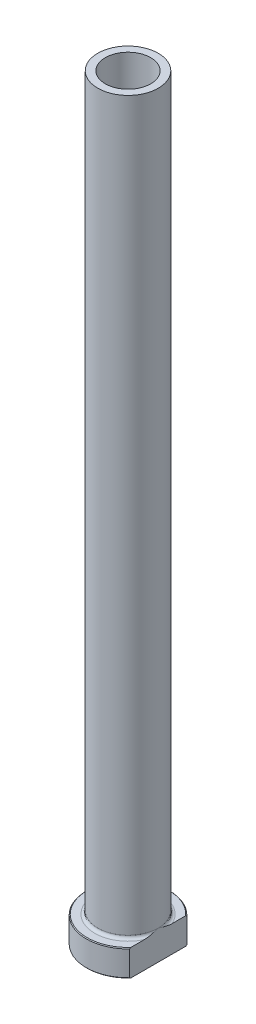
ISO-10303-21;
HEADER;
FILE_DESCRIPTION(('STEP AP214'),'2;1');
FILE_NAME('part.step','',(''),(''),'','','');
FILE_SCHEMA(('AUTOMOTIVE_DESIGN { 1 0 10303 214 1 1 1 1 }'));
ENDSEC;
DATA;
#1=APPLICATION_CONTEXT('core data for automotive mechanical design processes');
#2=APPLICATION_PROTOCOL_DEFINITION('international standard','automotive_design',2000,#1);
#3=PRODUCT_CONTEXT('',#1,'mechanical');
#4=PRODUCT('Part','Part','',(#3));
#5=PRODUCT_RELATED_PRODUCT_CATEGORY('part','',(#4));
#6=PRODUCT_DEFINITION_FORMATION('','',#4);
#7=PRODUCT_DEFINITION_CONTEXT('part definition',#1,'design');
#8=PRODUCT_DEFINITION('design','',#6,#7);
#9=PRODUCT_DEFINITION_SHAPE('','',#8);
#10=(LENGTH_UNIT() NAMED_UNIT(*) SI_UNIT(.MILLI.,.METRE.));
#11=(NAMED_UNIT(*) PLANE_ANGLE_UNIT() SI_UNIT($,.RADIAN.));
#12=(NAMED_UNIT(*) SI_UNIT($,.STERADIAN.) SOLID_ANGLE_UNIT());
#13=UNCERTAINTY_MEASURE_WITH_UNIT(LENGTH_MEASURE(1.E-05),#10,'distance_accuracy_value','');
#14=(GEOMETRIC_REPRESENTATION_CONTEXT(3) GLOBAL_UNCERTAINTY_ASSIGNED_CONTEXT((#13)) GLOBAL_UNIT_ASSIGNED_CONTEXT((#10,
#11,#12)) REPRESENTATION_CONTEXT('',''));
#15=CARTESIAN_POINT('',(0.,0.,0.));
#16=DIRECTION('',(0.,0.,1.));
#17=DIRECTION('',(1.,0.,0.));
#18=AXIS2_PLACEMENT_3D('',#15,#16,#17);
#19=CARTESIAN_POINT('',(0.,92.1876809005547,0.));
#20=DIRECTION('',(0.,1.,0.));
#21=DIRECTION('',(0.,0.,1.));
#22=AXIS2_PLACEMENT_3D('',#19,#20,#21);
#23=CYLINDRICAL_SURFACE('',#22,6.);
#24=CARTESIAN_POINT('',(0.,200.,0.));
#25=DIRECTION('',(0.,1.,0.));
#26=DIRECTION('',(0.,0.,1.));
#27=AXIS2_PLACEMENT_3D('',#24,#25,#26);
#28=CIRCLE('',#27,6.);
#29=CARTESIAN_POINT('',(0.,200.,6.));
#30=VERTEX_POINT('',#29);
#31=EDGE_CURVE('E167',#30,#30,#28,.T.);
#32=ORIENTED_EDGE('',*,*,#31,.T.);
#33=EDGE_LOOP('',(#32));
#34=FACE_BOUND('',#33,.T.);
#35=CARTESIAN_POINT('',(0.,145.,0.));
#36=DIRECTION('',(0.,1.,0.));
#37=DIRECTION('',(0.,0.,1.));
#38=AXIS2_PLACEMENT_3D('',#35,#36,#37);
#39=CIRCLE('',#38,6.);
#40=CARTESIAN_POINT('',(0.,145.,6.));
#41=VERTEX_POINT('',#40);
#42=EDGE_CURVE('E170',#41,#41,#39,.T.);
#43=ORIENTED_EDGE('',*,*,#42,.F.);
#44=EDGE_LOOP('',(#43));
#45=FACE_BOUND('',#44,.T.);
#46=ADVANCED_FACE('F32',(#34,#45),#23,.F.);
#47=CARTESIAN_POINT('',(-6.,200.,0.));
#48=DIRECTION('',(0.,1.,0.));
#49=DIRECTION('',(0.,0.,1.));
#50=AXIS2_PLACEMENT_3D('',#47,#48,#49);
#51=PLANE('',#50);
#52=CARTESIAN_POINT('',(0.,200.,0.));
#53=DIRECTION('',(0.,1.,0.));
#54=DIRECTION('',(0.,0.,1.));
#55=AXIS2_PLACEMENT_3D('',#52,#53,#54);
#56=CIRCLE('',#55,8.00000000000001);
#57=CARTESIAN_POINT('',(0.,200.,8.00000000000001));
#58=VERTEX_POINT('',#57);
#59=EDGE_CURVE('E174',#58,#58,#56,.T.);
#60=ORIENTED_EDGE('',*,*,#59,.T.);
#61=EDGE_LOOP('',(#60));
#62=FACE_BOUND('',#61,.T.);
#63=ORIENTED_EDGE('',*,*,#31,.F.);
#64=EDGE_LOOP('',(#63));
#65=FACE_BOUND('',#64,.T.);
#66=ADVANCED_FACE('F157',(#62,#65),#51,.T.);
#67=CARTESIAN_POINT('',(0.,92.1876809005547,0.));
#68=DIRECTION('',(0.,1.,0.));
#69=DIRECTION('',(0.,0.,1.));
#70=AXIS2_PLACEMENT_3D('',#67,#68,#69);
#71=CYLINDRICAL_SURFACE('',#70,8.);
#72=CARTESIAN_POINT('',(0.,7.8,0.));
#73=DIRECTION('',(0.,1.,0.));
#74=DIRECTION('',(0.,0.,1.));
#75=AXIS2_PLACEMENT_3D('',#72,#73,#74);
#76=CIRCLE('',#75,8.);
#77=CARTESIAN_POINT('',(8.,7.8,0.));
#78=VERTEX_POINT('',#77);
#79=EDGE_CURVE('E180',#78,#78,#76,.T.);
#80=ORIENTED_EDGE('',*,*,#79,.T.);
#81=EDGE_LOOP('',(#80));
#82=FACE_BOUND('',#81,.T.);
#83=ORIENTED_EDGE('',*,*,#59,.F.);
#84=EDGE_LOOP('',(#83));
#85=FACE_BOUND('',#84,.T.);
#86=ADVANCED_FACE('F162',(#82,#85),#71,.T.);
#87=CARTESIAN_POINT('',(-7.99999999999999,7.,0.));
#88=DIRECTION('',(0.,1.,0.));
#89=DIRECTION('',(0.,0.,1.));
#90=AXIS2_PLACEMENT_3D('',#87,#88,#89);
#91=PLANE('',#90);
#92=DIRECTION('',(0.,0.,1.));
#93=VECTOR('',#92,1.);
#94=CARTESIAN_POINT('',(8.,7.,0.));
#95=LINE('',#94,#93);
#96=CARTESIAN_POINT('',(8.,7.,-7.25534285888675));
#97=VERTEX_POINT('',#96);
#98=CARTESIAN_POINT('',(8.,7.,-3.66606055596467));
#99=VERTEX_POINT('',#98);
#100=EDGE_CURVE('E54',#97,#99,#95,.T.);
#101=ORIENTED_EDGE('',*,*,#100,.F.);
#102=CARTESIAN_POINT('',(0.,7.,0.));
#103=DIRECTION('',(0.,1.,0.));
#104=DIRECTION('',(0.,0.,1.));
#105=AXIS2_PLACEMENT_3D('',#102,#103,#104);
#106=CIRCLE('',#105,10.8);
#107=CARTESIAN_POINT('',(8.,7.,7.25534285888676));
#108=VERTEX_POINT('',#107);
#109=EDGE_CURVE('E186',#97,#108,#106,.T.);
#110=ORIENTED_EDGE('',*,*,#109,.T.);
#111=CARTESIAN_POINT('',(8.,7.,3.66606055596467));
#112=VERTEX_POINT('',#111);
#113=EDGE_CURVE('E134',#112,#108,#95,.T.);
#114=ORIENTED_EDGE('',*,*,#113,.F.);
#115=CARTESIAN_POINT('',(0.,7.,0.));
#116=DIRECTION('',(0.,1.,0.));
#117=DIRECTION('',(0.,0.,1.));
#118=AXIS2_PLACEMENT_3D('',#115,#116,#117);
#119=CIRCLE('',#118,8.8);
#120=EDGE_CURVE('E183',#112,#99,#119,.F.);
#121=ORIENTED_EDGE('',*,*,#120,.T.);
#122=EDGE_LOOP('',(#101,#110,#114,#121));
#123=FACE_BOUND('',#122,.T.);
#124=ADVANCED_FACE('F197',(#123),#91,.T.);
#125=CARTESIAN_POINT('',(0.,92.1876809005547,0.));
#126=DIRECTION('',(0.,1.,0.));
#127=DIRECTION('',(0.,0.,1.));
#128=AXIS2_PLACEMENT_3D('',#125,#126,#127);
#129=CYLINDRICAL_SURFACE('',#128,11.);
#130=DIRECTION('',(0.,-1.,0.));
#131=VECTOR('',#130,1.);
#132=CARTESIAN_POINT('',(8.,200.,7.54983443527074));
#133=LINE('',#132,#131);
#134=CARTESIAN_POINT('',(8.,6.79999999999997,7.54983443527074));
#135=VERTEX_POINT('',#134);
#136=CARTESIAN_POINT('',(8.,0.200000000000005,7.54983443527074));
#137=VERTEX_POINT('',#136);
#138=EDGE_CURVE('E82',#135,#137,#133,.T.);
#139=ORIENTED_EDGE('',*,*,#138,.F.);
#140=CARTESIAN_POINT('',(0.,6.79999999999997,0.));
#141=DIRECTION('',(0.,1.,0.));
#142=DIRECTION('',(0.,0.,1.));
#143=AXIS2_PLACEMENT_3D('',#140,#141,#142);
#144=CIRCLE('',#143,11.);
#145=CARTESIAN_POINT('',(8.,6.79999999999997,-7.54983443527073));
#146=VERTEX_POINT('',#145);
#147=EDGE_CURVE('E95',#135,#146,#144,.F.);
#148=ORIENTED_EDGE('',*,*,#147,.T.);
#149=DIRECTION('',(0.,-1.,0.));
#150=VECTOR('',#149,1.);
#151=CARTESIAN_POINT('',(8.,200.,-7.54983443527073));
#152=LINE('',#151,#150);
#153=CARTESIAN_POINT('',(8.,0.200000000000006,-7.54983443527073));
#154=VERTEX_POINT('',#153);
#155=EDGE_CURVE('E192',#146,#154,#152,.T.);
#156=ORIENTED_EDGE('',*,*,#155,.T.);
#157=CARTESIAN_POINT('',(0.,0.200000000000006,0.));
#158=DIRECTION('',(0.,-1.,0.));
#159=DIRECTION('',(0.,0.,-1.));
#160=AXIS2_PLACEMENT_3D('',#157,#158,#159);
#161=CIRCLE('',#160,11.);
#162=EDGE_CURVE('E98',#154,#137,#161,.F.);
#163=ORIENTED_EDGE('',*,*,#162,.T.);
#164=EDGE_LOOP('',(#139,#148,#156,#163));
#165=FACE_BOUND('',#164,.T.);
#166=ADVANCED_FACE('F190',(#165),#129,.T.);
#167=CARTESIAN_POINT('',(-11.,0.,0.));
#168=DIRECTION('',(0.,-1.,0.));
#169=DIRECTION('',(0.,0.,-1.));
#170=AXIS2_PLACEMENT_3D('',#167,#168,#169);
#171=PLANE('',#170);
#172=CARTESIAN_POINT('',(0.,0.,0.));
#173=DIRECTION('',(0.,-1.,0.));
#174=DIRECTION('',(0.,0.,-1.));
#175=AXIS2_PLACEMENT_3D('',#172,#173,#174);
#176=CIRCLE('',#175,6.75000000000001);
#177=CARTESIAN_POINT('',(0.,0.,-6.75000000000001));
#178=VERTEX_POINT('',#177);
#179=EDGE_CURVE('E40',#178,#178,#176,.F.);
#180=ORIENTED_EDGE('',*,*,#179,.T.);
#181=EDGE_LOOP('',(#180));
#182=FACE_BOUND('',#181,.T.);
#183=DIRECTION('',(0.,0.,-1.));
#184=VECTOR('',#183,1.);
#185=CARTESIAN_POINT('',(8.,0.,7.54983443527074));
#186=LINE('',#185,#184);
#187=CARTESIAN_POINT('',(8.,0.,7.25534285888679));
#188=VERTEX_POINT('',#187);
#189=CARTESIAN_POINT('',(8.,0.,-7.25534285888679));
#190=VERTEX_POINT('',#189);
#191=EDGE_CURVE('E47',#188,#190,#186,.T.);
#192=ORIENTED_EDGE('',*,*,#191,.F.);
#193=CARTESIAN_POINT('',(0.,0.,0.));
#194=DIRECTION('',(0.,-1.,0.));
#195=DIRECTION('',(0.,0.,-1.));
#196=AXIS2_PLACEMENT_3D('',#193,#194,#195);
#197=CIRCLE('',#196,10.8);
#198=EDGE_CURVE('E92',#188,#190,#197,.T.);
#199=ORIENTED_EDGE('',*,*,#198,.T.);
#200=EDGE_LOOP('',(#192,#199));
#201=FACE_BOUND('',#200,.T.);
#202=ADVANCED_FACE('F91',(#182,#201),#171,.T.);
#203=CARTESIAN_POINT('',(0.,92.1876809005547,0.));
#204=DIRECTION('',(0.,1.,0.));
#205=DIRECTION('',(0.,0.,1.));
#206=AXIS2_PLACEMENT_3D('',#203,#204,#205);
#207=CYLINDRICAL_SURFACE('',#206,6.25);
#208=CARTESIAN_POINT('',(0.,0.500000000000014,0.));
#209=DIRECTION('',(0.,-1.,0.));
#210=DIRECTION('',(0.,0.,-1.));
#211=AXIS2_PLACEMENT_3D('',#208,#209,#210);
#212=CIRCLE('',#211,6.25);
#213=CARTESIAN_POINT('',(0.,0.500000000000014,-6.25));
#214=VERTEX_POINT('',#213);
#215=EDGE_CURVE('E11',#214,#214,#212,.T.);
#216=ORIENTED_EDGE('',*,*,#215,.T.);
#217=EDGE_LOOP('',(#216));
#218=FACE_BOUND('',#217,.T.);
#219=CARTESIAN_POINT('',(0.,133.,0.));
#220=DIRECTION('',(0.,1.,0.));
#221=DIRECTION('',(0.,0.,1.));
#222=AXIS2_PLACEMENT_3D('',#219,#220,#221);
#223=CIRCLE('',#222,6.25000000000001);
#224=CARTESIAN_POINT('',(0.,133.,6.25000000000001));
#225=VERTEX_POINT('',#224);
#226=EDGE_CURVE('E172',#225,#225,#223,.T.);
#227=ORIENTED_EDGE('',*,*,#226,.T.);
#228=EDGE_LOOP('',(#227));
#229=FACE_BOUND('',#228,.T.);
#230=ADVANCED_FACE('F215',(#218,#229),#207,.F.);
#231=CARTESIAN_POINT('',(0.,133.,0.));
#232=DIRECTION('',(0.,-1.,0.));
#233=DIRECTION('',(0.,0.,-1.));
#234=AXIS2_PLACEMENT_3D('',#231,#232,#233);
#235=CONICAL_SURFACE('',#234,6.25000000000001,0.0208303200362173);
#236=ORIENTED_EDGE('',*,*,#42,.T.);
#237=EDGE_LOOP('',(#236));
#238=FACE_BOUND('',#237,.T.);
#239=ORIENTED_EDGE('',*,*,#226,.F.);
#240=EDGE_LOOP('',(#239));
#241=FACE_BOUND('',#240,.T.);
#242=ADVANCED_FACE('F111',(#238,#241),#235,.F.);
#243=CARTESIAN_POINT('',(0.,7.8,0.));
#244=DIRECTION('',(0.,1.,0.));
#245=DIRECTION('',(0.,0.,1.));
#246=AXIS2_PLACEMENT_3D('',#243,#244,#245);
#247=TOROIDAL_SURFACE('',#246,8.8,0.8);
#248=ORIENTED_EDGE('',*,*,#120,.F.);
#249=CARTESIAN_POINT('',(8.,7.8,0.));
#250=CARTESIAN_POINT('',(8.,7.80000101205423,-1.09664135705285E-10));
#251=CARTESIAN_POINT('',(8.,7.80000202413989,2.93324043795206E-07));
#252=CARTESIAN_POINT('',(8.,7.80000394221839,1.16283081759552E-06));
#253=CARTESIAN_POINT('',(8.,7.80000483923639,1.75365124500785E-06));
#254=CARTESIAN_POINT('',(8.,7.80000665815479,3.16446762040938E-06));
#255=CARTESIAN_POINT('',(8.,7.80000756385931,4.00549142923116E-06));
#256=CARTESIAN_POINT('',(8.,7.8000092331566,5.78347900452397E-06));
#257=CARTESIAN_POINT('',(8.,7.80000999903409,6.71842005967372E-06));
#258=CARTESIAN_POINT('',(8.,7.80001270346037,1.02037213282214E-05));
#259=CARTESIAN_POINT('',(8.,7.80001449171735,1.28740398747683E-05));
#260=CARTESIAN_POINT('',(8.,7.80001755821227,1.82727381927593E-05));
#261=CARTESIAN_POINT('',(8.,7.80001886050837,2.09881553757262E-05));
#262=CARTESIAN_POINT('',(8.,7.80002405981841,3.2064780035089E-05));
#263=CARTESIAN_POINT('',(8.,7.80002777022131,4.05225581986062E-05));
#264=CARTESIAN_POINT('',(8.,7.80003348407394,5.68037698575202E-05));
#265=CARTESIAN_POINT('',(8.,7.80003564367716,6.45728866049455E-05));
#266=CARTESIAN_POINT('',(8.,7.80005093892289,0.000121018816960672));
#267=CARTESIAN_POINT('',(8.,7.80006211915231,0.000170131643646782));
#268=CARTESIAN_POINT('',(8.,7.80011100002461,0.000362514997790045));
#269=CARTESIAN_POINT('',(8.,7.80015802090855,0.00050331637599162));
#270=CARTESIAN_POINT('',(8.,7.80033939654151,0.00105711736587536));
#271=CARTESIAN_POINT('',(8.,7.80046737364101,0.0014716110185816));
#272=CARTESIAN_POINT('',(8.,7.80097644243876,0.00310648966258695));
#273=CARTESIAN_POINT('',(8.,7.80136531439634,0.00432501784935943));
#274=CARTESIAN_POINT('',(8.,7.80297358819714,0.00937955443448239));
#275=CARTESIAN_POINT('',(8.,7.80418342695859,0.0132178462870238));
#276=CARTESIAN_POINT('',(7.99999999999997,7.82754122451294,0.0873020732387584));
#277=CARTESIAN_POINT('',(7.99999999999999,7.84979021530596,0.157524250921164));
#278=CARTESIAN_POINT('',(8.00000000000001,7.89322681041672,0.295235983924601));
#279=CARTESIAN_POINT('',(8.,7.91442151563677,0.362723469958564));
#280=CARTESIAN_POINT('',(8.,7.9592343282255,0.506178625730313));
#281=CARTESIAN_POINT('',(8.,7.98282525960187,0.582154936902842));
#282=CARTESIAN_POINT('',(8.,8.02983069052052,0.735069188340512));
#283=CARTESIAN_POINT('',(8.,8.05324046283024,0.812008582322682));
#284=CARTESIAN_POINT('',(8.,8.0930379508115,0.944645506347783));
#285=CARTESIAN_POINT('',(8.,8.10956807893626,1.0003002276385));
#286=CARTESIAN_POINT('',(8.,8.14221289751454,1.11157683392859));
#287=CARTESIAN_POINT('',(8.,8.15832854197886,1.16719843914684));
#288=CARTESIAN_POINT('',(8.,8.20527739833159,1.33164052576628));
#289=CARTESIAN_POINT('',(8.,8.23549814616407,1.44063711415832));
#290=CARTESIAN_POINT('',(8.,8.29826335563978,1.67606835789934));
#291=CARTESIAN_POINT('',(8.,8.33044741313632,1.80259995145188));
#292=CARTESIAN_POINT('',(8.,8.39126396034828,2.05750030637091));
#293=CARTESIAN_POINT('',(8.,8.41986879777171,2.18587573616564));
#294=CARTESIAN_POINT('',(8.,8.47414203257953,2.45321874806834));
#295=CARTESIAN_POINT('',(8.,8.49943375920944,2.59226394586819));
#296=CARTESIAN_POINT('',(8.,8.54278750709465,2.87150561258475));
#297=CARTESIAN_POINT('',(8.,8.56085024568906,3.0117019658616));
#298=CARTESIAN_POINT('',(8.,8.5829128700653,3.2431945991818));
#299=CARTESIAN_POINT('',(8.,8.58962750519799,3.33423069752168));
#300=CARTESIAN_POINT('',(8.,8.59844042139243,3.51651109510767));
#301=CARTESIAN_POINT('',(8.,8.60054027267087,3.60775531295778));
#302=CARTESIAN_POINT('',(8.,8.59923478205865,3.78855451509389));
#303=CARTESIAN_POINT('',(8.,8.59592927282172,3.87810991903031));
#304=CARTESIAN_POINT('',(8.,8.58288784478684,4.05671727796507));
#305=CARTESIAN_POINT('',(8.,8.57315718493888,4.14576958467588));
#306=CARTESIAN_POINT('',(8.,8.54786053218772,4.30910044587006));
#307=CARTESIAN_POINT('',(8.,8.53341905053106,4.38354919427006));
#308=CARTESIAN_POINT('',(8.,8.49747543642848,4.53120906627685));
#309=CARTESIAN_POINT('',(8.,8.47593618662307,4.60441150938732));
#310=CARTESIAN_POINT('',(8.,8.42376924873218,4.74853436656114));
#311=CARTESIAN_POINT('',(8.,8.39303920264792,4.81941853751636));
#312=CARTESIAN_POINT('',(8.,8.32008168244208,4.9549058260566));
#313=CARTESIAN_POINT('',(8.,8.27792970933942,5.01954653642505));
#314=CARTESIAN_POINT('',(8.,8.20692535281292,5.10354772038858));
#315=CARTESIAN_POINT('',(8.,8.183978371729,5.1278859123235));
#316=CARTESIAN_POINT('',(8.,8.13503511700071,5.17336988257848));
#317=CARTESIAN_POINT('',(8.,8.10903727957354,5.19451401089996));
#318=CARTESIAN_POINT('',(8.,8.05362521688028,5.23266411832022));
#319=CARTESIAN_POINT('',(8.,8.02417247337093,5.2496152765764));
#320=CARTESIAN_POINT('',(8.,7.96255238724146,5.27751973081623));
#321=CARTESIAN_POINT('',(8.,7.93039220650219,5.28848831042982));
#322=CARTESIAN_POINT('',(8.,7.87282733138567,5.30129051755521));
#323=CARTESIAN_POINT('',(8.,7.84777777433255,5.30473535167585));
#324=CARTESIAN_POINT('',(8.,7.79745799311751,5.30730687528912));
#325=CARTESIAN_POINT('',(8.,7.77218785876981,5.30643524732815));
#326=CARTESIAN_POINT('',(8.,7.72220872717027,5.30045124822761));
#327=CARTESIAN_POINT('',(8.,7.69749884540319,5.29534612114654));
#328=CARTESIAN_POINT('',(8.,7.6491985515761,5.28130622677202));
#329=CARTESIAN_POINT('',(8.,7.62560888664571,5.27236894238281));
#330=CARTESIAN_POINT('',(8.,7.57186978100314,5.24749103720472));
#331=CARTESIAN_POINT('',(8.,7.54235117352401,5.23019143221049));
#332=CARTESIAN_POINT('',(8.,7.48647501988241,5.19107874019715));
#333=CARTESIAN_POINT('',(8.,7.4601247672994,5.16925554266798));
#334=CARTESIAN_POINT('',(8.,7.3975813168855,5.11005232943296));
#335=CARTESIAN_POINT('',(8.,7.36345256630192,5.0705073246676));
#336=CARTESIAN_POINT('',(8.,7.30158414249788,4.98680536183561));
#337=CARTESIAN_POINT('',(8.,7.27385227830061,4.94264286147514));
#338=CARTESIAN_POINT('',(8.,7.2265563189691,4.85651446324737));
#339=CARTESIAN_POINT('',(8.,7.20642608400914,4.81485346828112));
#340=CARTESIAN_POINT('',(8.,7.16979237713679,4.72995016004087));
#341=CARTESIAN_POINT('',(8.,7.15329194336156,4.68670655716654));
#342=CARTESIAN_POINT('',(8.,7.10824755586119,4.55471342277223));
#343=CARTESIAN_POINT('',(8.,7.08448205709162,4.46433285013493));
#344=CARTESIAN_POINT('',(8.,7.04606817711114,4.27884520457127));
#345=CARTESIAN_POINT('',(8.,7.03172934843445,4.18367881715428));
#346=CARTESIAN_POINT('',(8.,7.01115182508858,3.99231790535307));
#347=CARTESIAN_POINT('',(8.,7.00492963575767,3.89612168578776));
#348=CARTESIAN_POINT('',(8.,6.99917472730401,3.70683203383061));
#349=CARTESIAN_POINT('',(8.,6.99942213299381,3.61374410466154));
#350=CARTESIAN_POINT('',(8.,7.00500334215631,3.42814181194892));
#351=CARTESIAN_POINT('',(8.,7.01031504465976,3.33562671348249));
#352=CARTESIAN_POINT('',(8.,7.02729273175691,3.12465235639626));
#353=CARTESIAN_POINT('',(8.,7.04033732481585,3.0063061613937));
#354=CARTESIAN_POINT('',(8.,7.07206018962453,2.77043320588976));
#355=CARTESIAN_POINT('',(8.,7.09073668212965,2.65290619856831));
#356=CARTESIAN_POINT('',(8.,7.13314336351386,2.41598317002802));
#357=CARTESIAN_POINT('',(8.,7.15698005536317,2.29660645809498));
#358=CARTESIAN_POINT('',(8.,7.20856500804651,2.05839418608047));
#359=CARTESIAN_POINT('',(8.,7.23632304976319,1.9395607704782));
#360=CARTESIAN_POINT('',(8.,7.30538420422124,1.66026758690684));
#361=CARTESIAN_POINT('',(8.,7.3479797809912,1.50012949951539));
#362=CARTESIAN_POINT('',(8.,7.43661699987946,1.18271330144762));
#363=CARTESIAN_POINT('',(8.,7.48261587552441,1.02542306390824));
#364=CARTESIAN_POINT('',(8.,7.55073856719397,0.798945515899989));
#365=CARTESIAN_POINT('',(8.,7.57189590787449,0.729464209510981));
#366=CARTESIAN_POINT('',(8.,7.61466169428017,0.590318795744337));
#367=CARTESIAN_POINT('',(8.,7.63627166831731,0.52065515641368));
#368=CARTESIAN_POINT('',(8.,7.68075896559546,0.378072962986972));
#369=CARTESIAN_POINT('',(8.00000000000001,7.70364749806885,0.305157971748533));
#370=CARTESIAN_POINT('',(7.99999999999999,7.74926260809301,0.16052269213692));
#371=CARTESIAN_POINT('',(7.99999999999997,7.77198614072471,0.0888015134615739));
#372=CARTESIAN_POINT('',(8.,7.79581756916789,0.0132146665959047));
#373=CARTESIAN_POINT('',(8.,7.79702841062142,0.00937319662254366));
#374=CARTESIAN_POINT('',(8.,7.79863692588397,0.00431792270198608));
#375=CARTESIAN_POINT('',(8.,7.79902501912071,0.00310183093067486));
#376=CARTESIAN_POINT('',(8.,7.79953313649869,0.00147000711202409));
#377=CARTESIAN_POINT('',(8.,7.79966092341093,0.00105612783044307));
#378=CARTESIAN_POINT('',(8.,7.7998420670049,0.000503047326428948));
#379=CARTESIAN_POINT('',(8.,7.79988905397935,0.000362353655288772));
#380=CARTESIAN_POINT('',(8.,7.79993790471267,0.000170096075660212));
#381=CARTESIAN_POINT('',(8.,7.79994908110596,0.000120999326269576));
#382=CARTESIAN_POINT('',(8.,7.7999643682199,6.45695818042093E-05));
#383=CARTESIAN_POINT('',(8.,7.7999665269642,5.68014487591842E-05));
#384=CARTESIAN_POINT('',(8.,7.79997223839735,4.05221710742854E-05));
#385=CARTESIAN_POINT('',(8.,7.79997594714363,3.20652931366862E-05));
#386=CARTESIAN_POINT('',(8.,7.79998114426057,2.09895708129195E-05));
#387=CARTESIAN_POINT('',(8.,7.79998244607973,1.82742270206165E-05));
#388=CARTESIAN_POINT('',(8.,7.7999855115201,1.28755893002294E-05));
#389=CARTESIAN_POINT('',(8.,7.79998729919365,1.02052505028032E-05));
#390=CARTESIAN_POINT('',(8.,7.79999000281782,6.71981903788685E-06));
#391=CARTESIAN_POINT('',(8.,7.79999076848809,5.78481830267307E-06));
#392=CARTESIAN_POINT('',(8.,7.79999243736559,4.00667403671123E-06));
#393=CARTESIAN_POINT('',(8.,7.79999334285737,3.16555239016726E-06));
#394=CARTESIAN_POINT('',(8.,7.79999516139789,1.75450243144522E-06));
#395=CARTESIAN_POINT('',(8.,7.79999605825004,1.16355323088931E-06));
#396=CARTESIAN_POINT('',(8.,7.7999979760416,2.9372828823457E-07));
#397=CARTESIAN_POINT('',(8.,7.79999898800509,1.09661384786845E-10));
#398=CARTESIAN_POINT('',(8.,7.8,0.));
#399=B_SPLINE_CURVE_WITH_KNOTS('',3,(#249,#250,#251,#252,#253,#254,#255,#256,#257,#258,#259,
#260,#261,#262,#263,#264,#265,#266,#267,#268,#269,#270,#271,#272,#273,#274,#275,#276,#277,#278,
#279,#280,#281,#282,#283,#284,#285,#286,#287,#288,#289,#290,#291,#292,#293,#294,#295,#296,#297,
#298,#299,#300,#301,#302,#303,#304,#305,#306,#307,#308,#309,#310,#311,#312,#313,#314,#315,#316,
#317,#318,#319,#320,#321,#322,#323,#324,#325,#326,#327,#328,#329,#330,#331,#332,#333,#334,#335,
#336,#337,#338,#339,#340,#341,#342,#343,#344,#345,#346,#347,#348,#349,#350,#351,#352,#353,#354,
#355,#356,#357,#358,#359,#360,#361,#362,#363,#364,#365,#366,#367,#368,#369,#370,#371,#372,#373,
#374,#375,#376,#377,#378,#379,#380,#381,#382,#383,#384,#385,#386,#387,#388,#389,#390,#391,#392,
#393,#394,#395,#396,#397,#398),.UNSPECIFIED.,.T.,.F.,(4,2,2,2,2,2,2,2,2,2,2,2,2,2,2,2,2,2,2,2,2,
2,2,2,2,2,2,2,2,2,2,2,2,2,2,2,2,2,2,2,2,2,2,2,2,2,2,2,2,2,2,2,2,2,2,2,2,2,2,2,2,2,2,2,2,2,2,2,2,
2,2,2,2,2,4),(0.,3.04287568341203E-06,6.25420182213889E-06,9.94386523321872E-06,
1.35664344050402E-05,2.31665045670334E-05,3.21939836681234E-05,5.98353420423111E-05,
8.39944711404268E-05,0.000235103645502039,0.000679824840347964,0.00198183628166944,
0.00581831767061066,0.0178924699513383,0.238870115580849,0.451084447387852,0.689746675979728,
0.931010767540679,1.10518257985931,1.27890913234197,1.61821807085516,2.0098553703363,
2.40435266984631,2.82819297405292,3.25199120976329,3.52574836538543,3.7994123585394,
4.06807884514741,4.33652570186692,4.5637808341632,4.79224376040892,5.02335234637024,
5.25296903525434,5.35309534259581,5.45327319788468,5.5546987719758,5.65586400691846,
5.73137360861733,5.80685377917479,5.88220505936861,5.95760590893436,6.05967508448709,
6.16197489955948,6.31780492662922,6.47382418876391,6.61243130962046,6.75115400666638,
7.03070266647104,7.31902502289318,7.60793277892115,7.88703491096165,8.16492456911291,
8.52193605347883,8.87883486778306,9.24395493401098,9.61000233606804,10.1070420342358,
10.5986476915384,10.8165407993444,11.0353545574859,11.2646261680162,11.4903206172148,
11.5024047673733,11.5062335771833,11.5075336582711,11.5079780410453,11.5081291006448,
11.508153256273,11.5081808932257,11.5081899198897,11.5081995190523,11.5082031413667,
11.5082068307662,11.5082100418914,11.5082130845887),.UNSPECIFIED.);
#400=EDGE_CURVE('E126',#112,#78,#399,.T.);
#401=ORIENTED_EDGE('',*,*,#400,.T.);
#402=ORIENTED_EDGE('',*,*,#79,.F.);
#403=CARTESIAN_POINT('',(8.,7.8,0.));
#404=CARTESIAN_POINT('',(8.,7.79999898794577,1.09667374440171E-10));
#405=CARTESIAN_POINT('',(8.,7.79999797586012,-2.93324040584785E-07));
#406=CARTESIAN_POINT('',(8.,7.79999605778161,-1.16283081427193E-06));
#407=CARTESIAN_POINT('',(8.,7.79999516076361,-1.75365124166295E-06));
#408=CARTESIAN_POINT('',(8.,7.79999334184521,-3.16446761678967E-06));
#409=CARTESIAN_POINT('',(8.,7.7999924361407,-4.00549142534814E-06));
#410=CARTESIAN_POINT('',(8.,7.79999076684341,-5.78347900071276E-06));
#411=CARTESIAN_POINT('',(8.,7.79999000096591,-6.71842005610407E-06));
#412=CARTESIAN_POINT('',(8.,7.79998729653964,-1.02037213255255E-05));
#413=CARTESIAN_POINT('',(8.,7.79998550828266,-1.28740398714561E-05));
#414=CARTESIAN_POINT('',(8.,7.79998244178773,-1.82727381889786E-05));
#415=CARTESIAN_POINT('',(8.,7.79998113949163,-2.09881553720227E-05));
#416=CARTESIAN_POINT('',(8.,7.7999759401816,-3.2064780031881E-05));
#417=CARTESIAN_POINT('',(8.,7.7999722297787,-4.05225581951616E-05));
#418=CARTESIAN_POINT('',(8.,7.79996651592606,-5.68037698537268E-05));
#419=CARTESIAN_POINT('',(8.,7.79996435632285,-6.45728866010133E-05));
#420=CARTESIAN_POINT('',(8.,7.79994906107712,-0.000121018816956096));
#421=CARTESIAN_POINT('',(8.,7.79993788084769,-0.000170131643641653));
#422=CARTESIAN_POINT('',(8.,7.7998889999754,-0.000362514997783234));
#423=CARTESIAN_POINT('',(8.,7.79984197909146,-0.000503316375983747));
#424=CARTESIAN_POINT('',(8.,7.7996606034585,-0.00105711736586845));
#425=CARTESIAN_POINT('',(8.,7.79953262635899,-0.00147161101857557));
#426=CARTESIAN_POINT('',(8.,7.79902355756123,-0.00310648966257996));
#427=CARTESIAN_POINT('',(8.,7.79863468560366,-0.00432501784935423));
#428=CARTESIAN_POINT('',(8.,7.79702641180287,-0.00937955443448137));
#429=CARTESIAN_POINT('',(8.,7.79581657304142,-0.0132178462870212));
#430=CARTESIAN_POINT('',(7.99999999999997,7.772458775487,-0.087302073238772));
#431=CARTESIAN_POINT('',(7.99999999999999,7.750209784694,-0.157524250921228));
#432=CARTESIAN_POINT('',(8.00000000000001,7.70677318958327,-0.295235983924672));
#433=CARTESIAN_POINT('',(8.,7.68557848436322,-0.362723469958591));
#434=CARTESIAN_POINT('',(8.,7.6407656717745,-0.50617862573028));
#435=CARTESIAN_POINT('',(8.,7.61717474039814,-0.582154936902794));
#436=CARTESIAN_POINT('',(8.,7.5701693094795,-0.735069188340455));
#437=CARTESIAN_POINT('',(8.,7.54675953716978,-0.812008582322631));
#438=CARTESIAN_POINT('',(8.,7.50696204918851,-0.944645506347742));
#439=CARTESIAN_POINT('',(8.,7.49043192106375,-1.00030022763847));
#440=CARTESIAN_POINT('',(8.,7.45778710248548,-1.11157683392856));
#441=CARTESIAN_POINT('',(8.,7.44167145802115,-1.16719843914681));
#442=CARTESIAN_POINT('',(8.,7.39472260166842,-1.33164052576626));
#443=CARTESIAN_POINT('',(8.,7.36450185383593,-1.4406371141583));
#444=CARTESIAN_POINT('',(8.,7.30173664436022,-1.67606835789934));
#445=CARTESIAN_POINT('',(8.,7.26955258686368,-1.80259995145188));
#446=CARTESIAN_POINT('',(8.,7.20873603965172,-2.05750030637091));
#447=CARTESIAN_POINT('',(8.,7.18013120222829,-2.18587573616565));
#448=CARTESIAN_POINT('',(8.,7.12585796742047,-2.45321874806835));
#449=CARTESIAN_POINT('',(8.,7.10056624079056,-2.5922639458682));
#450=CARTESIAN_POINT('',(8.,7.05721249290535,-2.87150561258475));
#451=CARTESIAN_POINT('',(8.,7.03914975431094,-3.01170196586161));
#452=CARTESIAN_POINT('',(8.,7.0170871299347,-3.2431945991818));
#453=CARTESIAN_POINT('',(8.,7.01037249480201,-3.33423069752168));
#454=CARTESIAN_POINT('',(8.,7.00155957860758,-3.51651109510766));
#455=CARTESIAN_POINT('',(8.,6.99945972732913,-3.60775531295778));
#456=CARTESIAN_POINT('',(8.,7.00076521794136,-3.78855451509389));
#457=CARTESIAN_POINT('',(8.,7.00407072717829,-3.87810991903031));
#458=CARTESIAN_POINT('',(8.,7.01711215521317,-4.05671727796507));
#459=CARTESIAN_POINT('',(8.,7.02684281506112,-4.14576958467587));
#460=CARTESIAN_POINT('',(8.,7.05213946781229,-4.30910044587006));
#461=CARTESIAN_POINT('',(8.,7.06658094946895,-4.38354919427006));
#462=CARTESIAN_POINT('',(8.,7.10252456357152,-4.53120906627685));
#463=CARTESIAN_POINT('',(8.,7.12406381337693,-4.60441150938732));
#464=CARTESIAN_POINT('',(8.,7.17623075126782,-4.74853436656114));
#465=CARTESIAN_POINT('',(8.,7.20696079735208,-4.81941853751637));
#466=CARTESIAN_POINT('',(8.,7.27991831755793,-4.95490582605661));
#467=CARTESIAN_POINT('',(8.,7.32207029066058,-5.01954653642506));
#468=CARTESIAN_POINT('',(8.,7.39307464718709,-5.10354772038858));
#469=CARTESIAN_POINT('',(8.,7.41602162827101,-5.1278859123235));
#470=CARTESIAN_POINT('',(8.,7.4649648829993,-5.17336988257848));
#471=CARTESIAN_POINT('',(8.,7.49096272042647,-5.19451401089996));
#472=CARTESIAN_POINT('',(8.,7.54637478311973,-5.23266411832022));
#473=CARTESIAN_POINT('',(8.,7.57582752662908,-5.2496152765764));
#474=CARTESIAN_POINT('',(8.,7.63744761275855,-5.27751973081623));
#475=CARTESIAN_POINT('',(8.,7.66960779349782,-5.28848831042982));
#476=CARTESIAN_POINT('',(8.,7.72717266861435,-5.30129051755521));
#477=CARTESIAN_POINT('',(8.,7.75222222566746,-5.30473535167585));
#478=CARTESIAN_POINT('',(8.,7.8025420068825,-5.30730687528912));
#479=CARTESIAN_POINT('',(8.,7.8278121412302,-5.30643524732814));
#480=CARTESIAN_POINT('',(8.,7.87779127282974,-5.30045124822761));
#481=CARTESIAN_POINT('',(8.,7.90250115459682,-5.29534612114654));
#482=CARTESIAN_POINT('',(8.,7.95080144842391,-5.28130622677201));
#483=CARTESIAN_POINT('',(8.,7.97439111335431,-5.2723689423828));
#484=CARTESIAN_POINT('',(8.,8.02813021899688,-5.24749103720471));
#485=CARTESIAN_POINT('',(8.,8.057648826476,-5.23019143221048));
#486=CARTESIAN_POINT('',(8.,8.1135249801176,-5.19107874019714));
#487=CARTESIAN_POINT('',(8.,8.13987523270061,-5.16925554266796));
#488=CARTESIAN_POINT('',(8.,8.20241868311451,-5.11005232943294));
#489=CARTESIAN_POINT('',(8.,8.2365474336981,-5.07050732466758));
#490=CARTESIAN_POINT('',(8.,8.29841585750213,-4.98680536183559));
#491=CARTESIAN_POINT('',(8.,8.3261477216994,-4.94264286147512));
#492=CARTESIAN_POINT('',(8.,8.37344368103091,-4.85651446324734));
#493=CARTESIAN_POINT('',(8.,8.39357391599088,-4.8148534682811));
#494=CARTESIAN_POINT('',(8.,8.43020762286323,-4.72995016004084));
#495=CARTESIAN_POINT('',(8.,8.44670805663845,-4.6867065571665));
#496=CARTESIAN_POINT('',(8.,8.49175244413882,-4.55471342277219));
#497=CARTESIAN_POINT('',(8.,8.51551794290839,-4.46433285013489));
#498=CARTESIAN_POINT('',(8.,8.55393182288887,-4.27884520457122));
#499=CARTESIAN_POINT('',(8.,8.56827065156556,-4.18367881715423));
#500=CARTESIAN_POINT('',(8.,8.58884817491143,-3.99231790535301));
#501=CARTESIAN_POINT('',(8.,8.59507036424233,-3.89612168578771));
#502=CARTESIAN_POINT('',(8.,8.60082527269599,-3.70683203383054));
#503=CARTESIAN_POINT('',(8.,8.6005778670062,-3.61374410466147));
#504=CARTESIAN_POINT('',(8.,8.59499665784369,-3.42814181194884));
#505=CARTESIAN_POINT('',(8.,8.58968495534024,-3.3356267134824));
#506=CARTESIAN_POINT('',(8.,8.57270726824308,-3.12465235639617));
#507=CARTESIAN_POINT('',(8.,8.55966267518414,-3.00630616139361));
#508=CARTESIAN_POINT('',(8.,8.52793981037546,-2.77043320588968));
#509=CARTESIAN_POINT('',(8.,8.50926331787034,-2.65290619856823));
#510=CARTESIAN_POINT('',(8.,8.46685663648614,-2.41598317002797));
#511=CARTESIAN_POINT('',(8.,8.44301994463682,-2.29660645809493));
#512=CARTESIAN_POINT('',(8.,8.39143499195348,-2.05839418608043));
#513=CARTESIAN_POINT('',(8.,8.3636769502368,-1.93956077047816));
#514=CARTESIAN_POINT('',(8.,8.29461579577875,-1.66026758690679));
#515=CARTESIAN_POINT('',(8.,8.2520202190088,-1.50012949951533));
#516=CARTESIAN_POINT('',(8.,8.16338300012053,-1.18271330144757));
#517=CARTESIAN_POINT('',(8.,8.11738412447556,-1.02542306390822));
#518=CARTESIAN_POINT('',(8.,8.04926143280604,-0.798945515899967));
#519=CARTESIAN_POINT('',(8.,8.02810409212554,-0.729464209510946));
#520=CARTESIAN_POINT('',(8.,7.98533830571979,-0.590318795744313));
#521=CARTESIAN_POINT('',(8.,7.96372833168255,-0.520655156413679));
#522=CARTESIAN_POINT('',(8.,7.91924103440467,-0.378072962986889));
#523=CARTESIAN_POINT('',(8.00000000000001,7.89635250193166,-0.305157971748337));
#524=CARTESIAN_POINT('',(7.99999999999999,7.85073739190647,-0.160522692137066));
#525=CARTESIAN_POINT('',(7.99999999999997,7.82801385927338,-0.0888015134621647));
#526=CARTESIAN_POINT('',(8.,7.80418243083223,-0.0132146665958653));
#527=CARTESIAN_POINT('',(8.,7.80297158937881,-0.00937319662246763));
#528=CARTESIAN_POINT('',(8.,7.80136307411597,-0.0043179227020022));
#529=CARTESIAN_POINT('',(8.,7.80097498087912,-0.00310183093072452));
#530=CARTESIAN_POINT('',(8.,7.8004668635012,-0.00147000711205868));
#531=CARTESIAN_POINT('',(8.,7.80033907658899,-0.00105612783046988));
#532=CARTESIAN_POINT('',(8.,7.80015793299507,-0.000503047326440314));
#533=CARTESIAN_POINT('',(8.,7.80011094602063,-0.00036235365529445));
#534=CARTESIAN_POINT('',(8.,7.80006209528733,-0.000170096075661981));
#535=CARTESIAN_POINT('',(8.,7.80005091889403,-0.000120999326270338));
#536=CARTESIAN_POINT('',(8.,7.8000356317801,-6.4569581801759E-05));
#537=CARTESIAN_POINT('',(8.,7.8000334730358,-5.6801448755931E-05));
#538=CARTESIAN_POINT('',(8.,7.80002776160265,-4.05221710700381E-05));
#539=CARTESIAN_POINT('',(8.,7.80002405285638,-3.20652931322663E-05));
#540=CARTESIAN_POINT('',(8.,7.80001885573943,-2.09895708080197E-05));
#541=CARTESIAN_POINT('',(8.,7.80001755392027,-1.82742270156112E-05));
#542=CARTESIAN_POINT('',(8.,7.8000144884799,-1.28755892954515E-05));
#543=CARTESIAN_POINT('',(8.,7.80001270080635,-1.02052504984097E-05));
#544=CARTESIAN_POINT('',(8.,7.80000999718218,-6.71981903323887E-06));
#545=CARTESIAN_POINT('',(8.,7.80000923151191,-5.78481829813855E-06));
#546=CARTESIAN_POINT('',(8.,7.80000756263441,-4.00667403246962E-06));
#547=CARTESIAN_POINT('',(8.,7.80000665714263,-3.16555238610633E-06));
#548=CARTESIAN_POINT('',(8.,7.80000483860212,-1.75450242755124E-06));
#549=CARTESIAN_POINT('',(8.,7.80000394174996,-1.16355322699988E-06));
#550=CARTESIAN_POINT('',(8.,7.80000202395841,-2.93728284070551E-07));
#551=CARTESIAN_POINT('',(8.,7.80000101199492,-1.09657271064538E-10));
#552=CARTESIAN_POINT('',(8.,7.8,0.));
#553=B_SPLINE_CURVE_WITH_KNOTS('',3,(#403,#404,#405,#406,#407,#408,#409,#410,#411,#412,#413,
#414,#415,#416,#417,#418,#419,#420,#421,#422,#423,#424,#425,#426,#427,#428,#429,#430,#431,#432,
#433,#434,#435,#436,#437,#438,#439,#440,#441,#442,#443,#444,#445,#446,#447,#448,#449,#450,#451,
#452,#453,#454,#455,#456,#457,#458,#459,#460,#461,#462,#463,#464,#465,#466,#467,#468,#469,#470,
#471,#472,#473,#474,#475,#476,#477,#478,#479,#480,#481,#482,#483,#484,#485,#486,#487,#488,#489,
#490,#491,#492,#493,#494,#495,#496,#497,#498,#499,#500,#501,#502,#503,#504,#505,#506,#507,#508,
#509,#510,#511,#512,#513,#514,#515,#516,#517,#518,#519,#520,#521,#522,#523,#524,#525,#526,#527,
#528,#529,#530,#531,#532,#533,#534,#535,#536,#537,#538,#539,#540,#541,#542,#543,#544,#545,#546,
#547,#548,#549,#550,#551,#552),.UNSPECIFIED.,.T.,.F.,(4,2,2,2,2,2,2,2,2,2,2,2,2,2,2,2,2,2,2,2,2,
2,2,2,2,2,2,2,2,2,2,2,2,2,2,2,2,2,2,2,2,2,2,2,2,2,2,2,2,2,2,2,2,2,2,2,2,2,2,2,2,2,2,2,2,2,2,2,2,
2,2,2,2,2,4),(0.,3.04287568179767E-06,6.25420182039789E-06,9.94386523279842E-06,
1.35664344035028E-05,2.31665045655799E-05,3.21939836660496E-05,5.98353420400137E-05,
8.39944711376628E-05,0.000235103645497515,0.000679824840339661,0.00198183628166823,
0.00581831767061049,0.017892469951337,0.238870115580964,0.45108444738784,0.689746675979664,
0.931010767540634,1.10518257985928,1.27890913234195,1.61821807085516,2.00985537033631,
2.40435266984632,2.82819297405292,3.25199120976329,3.52574836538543,3.7994123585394,
4.06807884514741,4.33652570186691,4.5637808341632,4.79224376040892,5.02335234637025,
5.25296903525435,5.35309534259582,5.45327319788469,5.55469877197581,5.65586400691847,
5.73137360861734,5.80685377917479,5.88220505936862,5.95760590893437,6.0596750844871,
6.16197489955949,6.31780492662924,6.47382418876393,6.61243130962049,6.75115400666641,
7.03070266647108,7.31902502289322,7.6079327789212,7.88703491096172,8.164924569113,
8.52193605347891,8.87883486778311,9.24395493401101,9.61000233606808,10.1070420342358,
10.5986476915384,10.8165407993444,11.0353545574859,11.2646261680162,11.4903206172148,
11.5024047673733,11.5062335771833,11.5075336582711,11.5079780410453,11.5081291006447,
11.508153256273,11.5081808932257,11.5081899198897,11.5081995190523,11.5082031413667,
11.5082068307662,11.5082100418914,11.5082130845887),.UNSPECIFIED.);
#554=EDGE_CURVE('E135',#78,#99,#553,.T.);
#555=ORIENTED_EDGE('',*,*,#554,.T.);
#556=EDGE_LOOP('',(#248,#401,#402,#555));
#557=FACE_BOUND('',#556,.T.);
#558=ADVANCED_FACE('F141',(#557),#247,.F.);
#559=CARTESIAN_POINT('',(0.,7.00000000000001,0.));
#560=DIRECTION('',(0.,-1.,0.));
#561=DIRECTION('',(0.,0.,-1.));
#562=AXIS2_PLACEMENT_3D('',#559,#560,#561);
#563=CONICAL_SURFACE('',#562,10.7999999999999,0.785398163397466);
#564=CARTESIAN_POINT('',(8.,-0.636730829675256,-16.6106304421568));
#565=CARTESIAN_POINT('',(8.,-0.418611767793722,-16.3685283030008));
#566=CARTESIAN_POINT('',(8.,-0.200984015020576,-16.125984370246));
#567=CARTESIAN_POINT('',(8.,0.233148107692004,-15.6398927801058));
#568=CARTESIAN_POINT('',(8.,0.449652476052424,-15.3963451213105));
#569=CARTESIAN_POINT('',(8.,1.09739989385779,-14.6638687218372));
#570=CARTESIAN_POINT('',(8.,1.52674426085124,-14.1732538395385));
#571=CARTESIAN_POINT('',(8.,2.16792810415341,-13.4304656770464));
#572=CARTESIAN_POINT('',(8.,2.38226067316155,-13.1804430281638));
#573=CARTESIAN_POINT('',(8.,2.8089295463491,-12.6787083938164));
#574=CARTESIAN_POINT('',(8.,3.02126589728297,-12.4269964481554));
#575=CARTESIAN_POINT('',(8.,3.44357020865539,-11.9216744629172));
#576=CARTESIAN_POINT('',(8.,3.65353861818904,-11.6680647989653));
#577=CARTESIAN_POINT('',(8.,4.07074862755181,-11.1585723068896));
#578=CARTESIAN_POINT('',(8.,4.27798998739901,-10.9026892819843));
#579=CARTESIAN_POINT('',(8.,4.66965190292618,-10.4127607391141));
#580=CARTESIAN_POINT('',(8.,4.85436868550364,-10.1789522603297));
#581=CARTESIAN_POINT('',(8.,5.22063517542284,-9.70886883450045));
#582=CARTESIAN_POINT('',(8.,5.40218492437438,-9.47259391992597));
#583=CARTESIAN_POINT('',(8.,5.76149237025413,-8.99721569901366));
#584=CARTESIAN_POINT('',(8.,5.93925050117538,-8.75811272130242));
#585=CARTESIAN_POINT('',(8.,6.29022306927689,-8.27660199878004));
#586=CARTESIAN_POINT('',(8.,6.4634376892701,-8.03419438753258));
#587=CARTESIAN_POINT('',(8.,6.80398487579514,-7.54604999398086));
#588=CARTESIAN_POINT('',(8.,6.97132935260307,-7.30032154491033));
#589=CARTESIAN_POINT('',(8.,7.29928849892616,-6.80437777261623));
#590=CARTESIAN_POINT('',(8.,7.45990280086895,-6.55416220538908));
#591=CARTESIAN_POINT('',(8.,7.77264940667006,-6.04873149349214));
#592=CARTESIAN_POINT('',(8.,7.92478824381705,-5.7935204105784));
#593=CARTESIAN_POINT('',(8.,8.21859570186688,-5.27715744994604));
#594=CARTESIAN_POINT('',(8.,8.36026610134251,-5.0160065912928));
#595=CARTESIAN_POINT('',(8.,8.62213596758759,-4.50319242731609));
#596=CARTESIAN_POINT('',(8.,8.74311989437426,-4.25193242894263));
#597=CARTESIAN_POINT('',(8.,8.97065709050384,-3.74287674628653));
#598=CARTESIAN_POINT('',(8.,9.07720941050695,-3.48508063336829));
#599=CARTESIAN_POINT('',(8.,9.27220860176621,-2.96337495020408));
#600=CARTESIAN_POINT('',(8.,9.36069936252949,-2.69948197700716));
#601=CARTESIAN_POINT('',(8.,9.51604316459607,-2.16542713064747));
#602=CARTESIAN_POINT('',(8.,9.58290677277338,-1.89526838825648));
#603=CARTESIAN_POINT('',(8.,9.68291221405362,-1.39216000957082));
#604=CARTESIAN_POINT('',(8.,9.71967474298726,-1.15993430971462));
#605=CARTESIAN_POINT('',(8.,9.77336730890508,-0.693196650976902));
#606=CARTESIAN_POINT('',(8.,9.79030037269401,-0.458685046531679));
#607=CARTESIAN_POINT('',(8.,9.80342851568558,0.010672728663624));
#608=CARTESIAN_POINT('',(8.,9.79964609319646,0.245518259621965));
#609=CARTESIAN_POINT('',(8.,9.77160926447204,0.713989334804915));
#610=CARTESIAN_POINT('',(8.,9.74735189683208,0.947614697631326));
#611=CARTESIAN_POINT('',(8.,9.670708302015,1.47287443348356));
#612=CARTESIAN_POINT('',(8.,9.61261890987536,1.76367634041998));
#613=CARTESIAN_POINT('',(8.,9.46982192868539,2.33873282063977));
#614=CARTESIAN_POINT('',(8.,9.38509750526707,2.6229831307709));
#615=CARTESIAN_POINT('',(8.,9.24134311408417,3.0443685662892));
#616=CARTESIAN_POINT('',(8.,9.19048552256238,3.18437323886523));
#617=CARTESIAN_POINT('',(8.,9.08381674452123,3.46241560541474));
#618=CARTESIAN_POINT('',(8.,9.02800782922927,3.60045416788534));
#619=CARTESIAN_POINT('',(8.,8.91195481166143,3.87463242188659));
#620=CARTESIAN_POINT('',(8.,8.85171106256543,4.0107722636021));
#621=CARTESIAN_POINT('',(8.,8.72725899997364,4.28124317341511));
#622=CARTESIAN_POINT('',(8.,8.66305017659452,4.41557400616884));
#623=CARTESIAN_POINT('',(8.,8.4898473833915,4.76597692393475));
#624=CARTESIAN_POINT('',(8.,8.37796178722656,4.98062176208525));
#625=CARTESIAN_POINT('',(8.,8.14649205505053,5.40573762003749));
#626=CARTESIAN_POINT('',(8.,8.02690659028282,5.61620791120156));
#627=CARTESIAN_POINT('',(8.,7.78128707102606,6.03349586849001));
#628=CARTESIAN_POINT('',(8.,7.65524949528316,6.24031145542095));
#629=CARTESIAN_POINT('',(8.,7.39783636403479,6.65060320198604));
#630=CARTESIAN_POINT('',(8.,7.26646042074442,6.85407911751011));
#631=CARTESIAN_POINT('',(8.,6.99890352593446,7.25856399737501));
#632=CARTESIAN_POINT('',(8.,6.86271149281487,7.45956561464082));
#633=CARTESIAN_POINT('',(8.,6.58651908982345,7.85893907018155));
#634=CARTESIAN_POINT('',(8.,6.44651858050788,8.05731081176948));
#635=CARTESIAN_POINT('',(8.,6.0217824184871,8.64881247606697));
#636=CARTESIAN_POINT('',(8.,5.73221467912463,9.03847436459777));
#637=CARTESIAN_POINT('',(8.,5.14234581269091,9.81218500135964));
#638=CARTESIAN_POINT('',(8.,4.84200393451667,10.1962024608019));
#639=CARTESIAN_POINT('',(8.,4.234048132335,10.9584616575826));
#640=CARTESIAN_POINT('',(7.99999999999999,3.92643376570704,11.3367030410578));
#641=CARTESIAN_POINT('',(7.99999999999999,3.3060074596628,12.0880358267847));
#642=CARTESIAN_POINT('',(7.99999999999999,2.99320302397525,12.4611334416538));
#643=CARTESIAN_POINT('',(7.99999999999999,2.36317801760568,13.2035599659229));
#644=CARTESIAN_POINT('',(7.99999999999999,2.0459575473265,13.5728889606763));
#645=CARTESIAN_POINT('',(7.99999999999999,1.33644011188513,14.3909378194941));
#646=CARTESIAN_POINT('',(7.99999999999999,0.943258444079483,14.8388897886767));
#647=CARTESIAN_POINT('',(7.99999999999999,0.351483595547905,15.5068127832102));
#648=CARTESIAN_POINT('',(7.99999999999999,0.154449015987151,15.7281687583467));
#649=CARTESIAN_POINT('',(7.99999999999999,-0.240498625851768,16.1700151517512));
#650=CARTESIAN_POINT('',(7.99999999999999,-0.438411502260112,16.3905057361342));
#651=CARTESIAN_POINT('',(7.99999999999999,-0.636730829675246,16.6106304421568));
#652=B_SPLINE_CURVE_WITH_KNOTS('',3,(#564,#565,#566,#567,#568,#569,#570,#571,#572,#573,#574,
#575,#576,#577,#578,#579,#580,#581,#582,#583,#584,#585,#586,#587,#588,#589,#590,#591,#592,#593,
#594,#595,#596,#597,#598,#599,#600,#601,#602,#603,#604,#605,#606,#607,#608,#609,#610,#611,#612,
#613,#614,#615,#616,#617,#618,#619,#620,#621,#622,#623,#624,#625,#626,#627,#628,#629,#630,#631,
#632,#633,#634,#635,#636,#637,#638,#639,#640,#641,#642,#643,#644,#645,#646,#647,#648,#649,#650,
#651),.UNSPECIFIED.,.F.,.F.,(4,2,2,2,2,2,2,2,2,2,2,2,2,2,2,2,2,2,2,2,2,2,2,2,2,2,2,2,2,2,2,2,2,
2,2,2,2,2,2,2,2,2,2,4),(0.,0.97759892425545,1.95519922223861,3.91099512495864,4.89893858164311,
5.88685884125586,6.87458847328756,7.86240445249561,8.75629469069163,9.65017317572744,
10.543948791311,11.4376883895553,12.3294952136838,13.2213506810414,14.1125088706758,
15.0035153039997,15.8397621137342,16.676063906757,17.5103086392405,18.3441451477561,
19.0487229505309,19.7531931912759,20.456898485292,21.1607055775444,22.0488428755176,
22.9375426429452,23.3843335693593,23.8309205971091,24.2774720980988,24.7240811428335,
25.4500411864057,26.1761268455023,26.9026130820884,27.6291521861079,28.3574884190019,
29.085851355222,30.542052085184,32.0045059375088,33.4670490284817,34.927635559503,
36.3881889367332,38.176245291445,39.0652821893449,39.9541391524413),.UNSPECIFIED.);
#653=EDGE_CURVE('E133',#146,#97,#652,.T.);
#654=ORIENTED_EDGE('',*,*,#653,.F.);
#655=ORIENTED_EDGE('',*,*,#147,.F.);
#656=EDGE_CURVE('E118',#108,#135,#652,.T.);
#657=ORIENTED_EDGE('',*,*,#656,.F.);
#658=ORIENTED_EDGE('',*,*,#109,.F.);
#659=EDGE_LOOP('',(#654,#655,#657,#658));
#660=FACE_BOUND('',#659,.T.);
#661=ADVANCED_FACE('F145',(#660),#563,.T.);
#662=CARTESIAN_POINT('',(0.,0.200000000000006,0.));
#663=DIRECTION('',(0.,1.,0.));
#664=DIRECTION('',(0.,0.,1.));
#665=AXIS2_PLACEMENT_3D('',#662,#663,#664);
#666=CONICAL_SURFACE('',#665,11.,0.785398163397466);
#667=CARTESIAN_POINT('',(7.99999999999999,7.63673082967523,16.6106304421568));
#668=CARTESIAN_POINT('',(7.99999999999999,7.4186117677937,16.3685283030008));
#669=CARTESIAN_POINT('',(7.99999999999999,7.20098401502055,16.125984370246));
#670=CARTESIAN_POINT('',(7.99999999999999,6.76685189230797,15.6398927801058));
#671=CARTESIAN_POINT('',(7.99999999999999,6.55034752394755,15.3963451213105));
#672=CARTESIAN_POINT('',(7.99999999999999,5.90260010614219,14.6638687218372));
#673=CARTESIAN_POINT('',(7.99999999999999,5.47325573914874,14.1732538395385));
#674=CARTESIAN_POINT('',(7.99999999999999,4.83207189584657,13.4304656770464));
#675=CARTESIAN_POINT('',(7.99999999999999,4.61773932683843,13.1804430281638));
#676=CARTESIAN_POINT('',(7.99999999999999,4.19107045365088,12.6787083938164));
#677=CARTESIAN_POINT('',(7.99999999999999,3.97873410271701,12.4269964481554));
#678=CARTESIAN_POINT('',(7.99999999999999,3.55642979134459,11.9216744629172));
#679=CARTESIAN_POINT('',(7.99999999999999,3.34646138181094,11.6680647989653));
#680=CARTESIAN_POINT('',(7.99999999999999,2.92925137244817,11.1585723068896));
#681=CARTESIAN_POINT('',(8.,2.72201001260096,10.9026892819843));
#682=CARTESIAN_POINT('',(8.,2.33034809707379,10.4127607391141));
#683=CARTESIAN_POINT('',(8.,2.14563131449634,10.1789522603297));
#684=CARTESIAN_POINT('',(8.,1.77936482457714,9.70886883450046));
#685=CARTESIAN_POINT('',(8.,1.59781507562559,9.47259391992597));
#686=CARTESIAN_POINT('',(8.,1.23850762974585,8.99721569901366));
#687=CARTESIAN_POINT('',(8.,1.0607494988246,8.75811272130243));
#688=CARTESIAN_POINT('',(8.,0.709776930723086,8.27660199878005));
#689=CARTESIAN_POINT('',(8.,0.536562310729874,8.03419438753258));
#690=CARTESIAN_POINT('',(8.,0.196015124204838,7.54604999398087));
#691=CARTESIAN_POINT('',(8.,0.0286706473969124,7.30032154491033));
#692=CARTESIAN_POINT('',(8.,-0.299288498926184,6.80437777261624));
#693=CARTESIAN_POINT('',(8.,-0.459902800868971,6.55416220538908));
#694=CARTESIAN_POINT('',(8.,-0.772649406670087,6.04873149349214));
#695=CARTESIAN_POINT('',(8.,-0.924788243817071,5.7935204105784));
#696=CARTESIAN_POINT('',(8.,-1.2185957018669,5.27715744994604));
#697=CARTESIAN_POINT('',(8.,-1.36026610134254,5.0160065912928));
#698=CARTESIAN_POINT('',(8.,-1.62213596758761,4.50319242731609));
#699=CARTESIAN_POINT('',(8.,-1.74311989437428,4.25193242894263));
#700=CARTESIAN_POINT('',(8.,-1.97065709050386,3.74287674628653));
#701=CARTESIAN_POINT('',(8.,-2.07720941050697,3.4850806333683));
#702=CARTESIAN_POINT('',(8.,-2.27220860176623,2.96337495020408));
#703=CARTESIAN_POINT('',(8.,-2.36069936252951,2.69948197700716));
#704=CARTESIAN_POINT('',(8.,-2.51604316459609,2.16542713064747));
#705=CARTESIAN_POINT('',(8.,-2.5829067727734,1.89526838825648));
#706=CARTESIAN_POINT('',(8.,-2.68291221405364,1.39216000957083));
#707=CARTESIAN_POINT('',(8.,-2.71967474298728,1.15993430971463));
#708=CARTESIAN_POINT('',(8.,-2.7733673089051,0.693196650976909));
#709=CARTESIAN_POINT('',(8.,-2.79030037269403,0.458685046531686));
#710=CARTESIAN_POINT('',(8.,-2.8034285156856,-0.0106727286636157));
#711=CARTESIAN_POINT('',(8.,-2.79964609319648,-0.245518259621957));
#712=CARTESIAN_POINT('',(8.,-2.77160926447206,-0.713989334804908));
#713=CARTESIAN_POINT('',(8.,-2.7473518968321,-0.94761469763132));
#714=CARTESIAN_POINT('',(8.,-2.67070830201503,-1.47287443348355));
#715=CARTESIAN_POINT('',(8.,-2.61261890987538,-1.76367634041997));
#716=CARTESIAN_POINT('',(8.,-2.46982192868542,-2.33873282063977));
#717=CARTESIAN_POINT('',(8.,-2.38509750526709,-2.62298313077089));
#718=CARTESIAN_POINT('',(8.,-2.24134311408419,-3.04436856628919));
#719=CARTESIAN_POINT('',(8.,-2.1904855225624,-3.18437323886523));
#720=CARTESIAN_POINT('',(8.,-2.08381674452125,-3.46241560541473));
#721=CARTESIAN_POINT('',(8.,-2.02800782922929,-3.60045416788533));
#722=CARTESIAN_POINT('',(8.,-1.91195481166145,-3.87463242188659));
#723=CARTESIAN_POINT('',(8.,-1.85171106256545,-4.01077226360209));
#724=CARTESIAN_POINT('',(8.,-1.72725899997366,-4.2812431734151));
#725=CARTESIAN_POINT('',(8.,-1.66305017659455,-4.41557400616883));
#726=CARTESIAN_POINT('',(8.,-1.48984738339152,-4.76597692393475));
#727=CARTESIAN_POINT('',(8.,-1.37796178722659,-4.98062176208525));
#728=CARTESIAN_POINT('',(8.,-1.14649205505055,-5.40573762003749));
#729=CARTESIAN_POINT('',(8.,-1.02690659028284,-5.61620791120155));
#730=CARTESIAN_POINT('',(8.,-0.781287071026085,-6.03349586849));
#731=CARTESIAN_POINT('',(8.,-0.655249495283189,-6.24031145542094));
#732=CARTESIAN_POINT('',(8.,-0.397836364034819,-6.65060320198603));
#733=CARTESIAN_POINT('',(8.,-0.266460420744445,-6.8540791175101));
#734=CARTESIAN_POINT('',(8.,0.0010964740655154,-7.258563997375));
#735=CARTESIAN_POINT('',(8.,0.137288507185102,-7.45956561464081));
#736=CARTESIAN_POINT('',(8.,0.413480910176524,-7.85893907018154));
#737=CARTESIAN_POINT('',(8.,0.55348141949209,-8.05731081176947));
#738=CARTESIAN_POINT('',(8.,0.978217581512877,-8.64881247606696));
#739=CARTESIAN_POINT('',(8.,1.26778532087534,-9.03847436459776));
#740=CARTESIAN_POINT('',(8.,1.85765418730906,-9.81218500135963));
#741=CARTESIAN_POINT('',(8.,2.1579960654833,-10.1962024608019));
#742=CARTESIAN_POINT('',(8.,2.76595186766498,-10.9584616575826));
#743=CARTESIAN_POINT('',(8.,3.07356623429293,-11.3367030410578));
#744=CARTESIAN_POINT('',(8.,3.69399254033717,-12.0880358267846));
#745=CARTESIAN_POINT('',(8.,4.00679697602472,-12.4611334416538));
#746=CARTESIAN_POINT('',(8.,4.63682198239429,-13.2035599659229));
#747=CARTESIAN_POINT('',(8.,4.95404245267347,-13.5728889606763));
#748=CARTESIAN_POINT('',(8.,5.66355988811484,-14.3909378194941));
#749=CARTESIAN_POINT('',(8.,6.05674155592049,-14.8388897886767));
#750=CARTESIAN_POINT('',(8.,6.64851640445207,-15.5068127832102));
#751=CARTESIAN_POINT('',(8.,6.84555098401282,-15.7281687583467));
#752=CARTESIAN_POINT('',(8.,7.24049862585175,-16.1700151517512));
#753=CARTESIAN_POINT('',(8.,7.43841150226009,-16.3905057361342));
#754=CARTESIAN_POINT('',(8.,7.63673082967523,-16.6106304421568));
#755=B_SPLINE_CURVE_WITH_KNOTS('',3,(#667,#668,#669,#670,#671,#672,#673,#674,#675,#676,#677,
#678,#679,#680,#681,#682,#683,#684,#685,#686,#687,#688,#689,#690,#691,#692,#693,#694,#695,#696,
#697,#698,#699,#700,#701,#702,#703,#704,#705,#706,#707,#708,#709,#710,#711,#712,#713,#714,#715,
#716,#717,#718,#719,#720,#721,#722,#723,#724,#725,#726,#727,#728,#729,#730,#731,#732,#733,#734,
#735,#736,#737,#738,#739,#740,#741,#742,#743,#744,#745,#746,#747,#748,#749,#750,#751,#752,#753,
#754),.UNSPECIFIED.,.F.,.F.,(4,2,2,2,2,2,2,2,2,2,2,2,2,2,2,2,2,2,2,2,2,2,2,2,2,2,2,2,2,2,2,2,2,
2,2,2,2,2,2,2,2,2,2,4),(0.,0.977598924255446,1.95519922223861,3.91099512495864,4.8989385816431,
5.88685884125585,6.87458847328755,7.86240445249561,8.75629469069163,9.65017317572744,
10.5439487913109,11.4376883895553,12.3294952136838,13.2213506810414,14.1125088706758,
15.0035153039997,15.8397621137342,16.676063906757,17.5103086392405,18.3441451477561,
19.0487229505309,19.7531931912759,20.4568984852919,21.1607055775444,22.0488428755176,
22.9375426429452,23.3843335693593,23.8309205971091,24.2774720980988,24.7240811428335,
25.4500411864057,26.1761268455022,26.9026130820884,27.6291521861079,28.3574884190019,
29.085851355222,30.5420520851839,32.0045059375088,33.4670490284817,34.927635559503,
36.3881889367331,38.176245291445,39.0652821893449,39.9541391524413),.UNSPECIFIED.);
#756=EDGE_CURVE('E79',#137,#188,#755,.T.);
#757=ORIENTED_EDGE('',*,*,#756,.F.);
#758=ORIENTED_EDGE('',*,*,#162,.F.);
#759=EDGE_CURVE('E87',#190,#154,#755,.T.);
#760=ORIENTED_EDGE('',*,*,#759,.F.);
#761=ORIENTED_EDGE('',*,*,#198,.F.);
#762=EDGE_LOOP('',(#757,#758,#760,#761));
#763=FACE_BOUND('',#762,.T.);
#764=ADVANCED_FACE('F94',(#763),#666,.T.);
#765=CARTESIAN_POINT('',(8.,200.,7.54983443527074));
#766=DIRECTION('',(-1.,0.,0.));
#767=DIRECTION('',(0.,0.,1.));
#768=AXIS2_PLACEMENT_3D('',#765,#766,#767);
#769=PLANE('',#768);
#770=ORIENTED_EDGE('',*,*,#400,.F.);
#771=ORIENTED_EDGE('',*,*,#113,.T.);
#772=ORIENTED_EDGE('',*,*,#656,.T.);
#773=ORIENTED_EDGE('',*,*,#138,.T.);
#774=ORIENTED_EDGE('',*,*,#756,.T.);
#775=ORIENTED_EDGE('',*,*,#191,.T.);
#776=ORIENTED_EDGE('',*,*,#759,.T.);
#777=ORIENTED_EDGE('',*,*,#155,.F.);
#778=ORIENTED_EDGE('',*,*,#653,.T.);
#779=ORIENTED_EDGE('',*,*,#100,.T.);
#780=ORIENTED_EDGE('',*,*,#554,.F.);
#781=EDGE_LOOP('',(#770,#771,#772,#773,#774,#775,#776,#777,#778,#779,#780));
#782=FACE_BOUND('',#781,.T.);
#783=ADVANCED_FACE('F80',(#782),#769,.F.);
#784=CARTESIAN_POINT('',(0.,0.,0.));
#785=DIRECTION('',(0.,-1.,0.));
#786=DIRECTION('',(0.,0.,-1.));
#787=AXIS2_PLACEMENT_3D('',#784,#785,#786);
#788=CONICAL_SURFACE('',#787,6.75000000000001,0.785398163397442);
#789=ORIENTED_EDGE('',*,*,#215,.F.);
#790=EDGE_LOOP('',(#789));
#791=FACE_BOUND('',#790,.T.);
#792=ORIENTED_EDGE('',*,*,#179,.F.);
#793=EDGE_LOOP('',(#792));
#794=FACE_BOUND('',#793,.T.);
#795=ADVANCED_FACE('F34',(#791,#794),#788,.F.);
#796=CLOSED_SHELL('',(#46,#66,#86,#124,#166,#202,#230,#242,#558,#661,#764,#783,#795));
#797=MANIFOLD_SOLID_BREP('B2',#796);
#798=ADVANCED_BREP_SHAPE_REPRESENTATION('',(#18,#797),#14);
#799=SHAPE_DEFINITION_REPRESENTATION(#9,#798);
ENDSEC;
END-ISO-10303-21;
